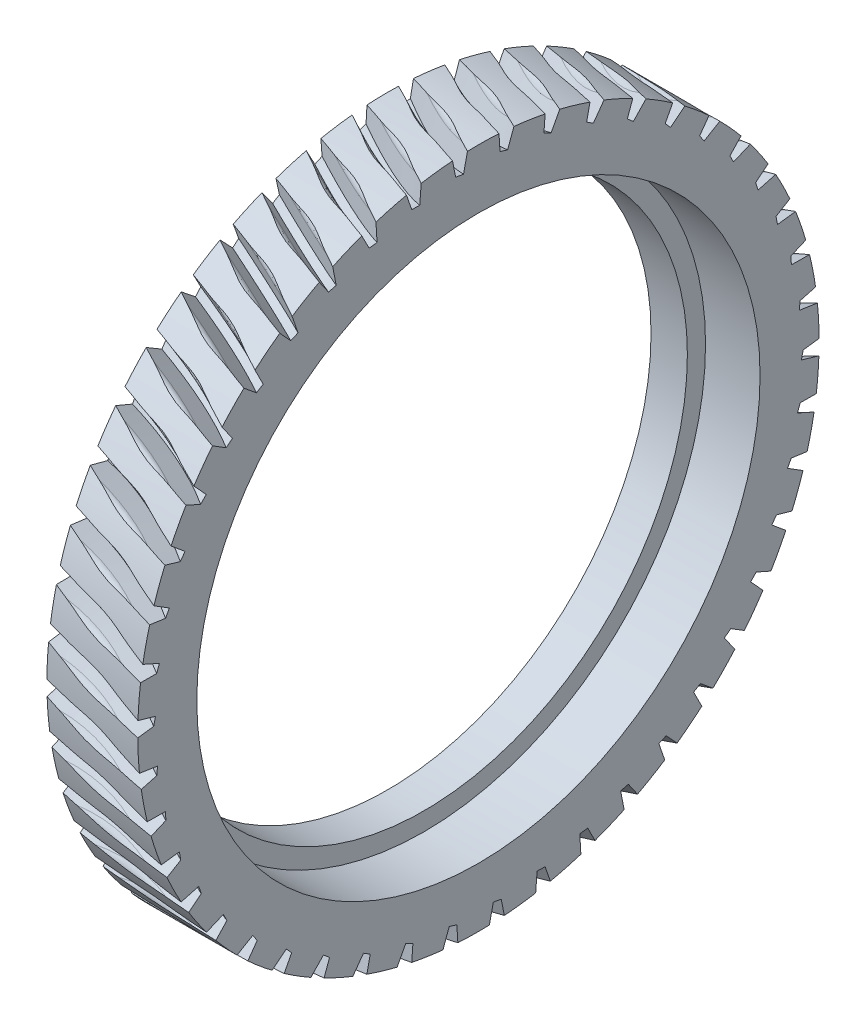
from build123d import *

# Parameters (mm, degrees)
R_P_TITION_CIRCULAIRE1_COUNT = 46


with BuildPart() as part:
    # Esquisse1 → Base-R_volution (revolve)
    with BuildSketch(Plane.XY, mode=Mode.PRIVATE) as base_r_volution_sk:
        Polygon((0, 31), (0, 37.5), (-10, 37.5), (-10, 29), (-6, 29), (-6, 31), align=None)
    revolve(base_r_volution_sk.sketch.rotate(Axis((0, 0, 0), (1, 0, 0)), 90), axis=Axis((0, 0, 0), (1, 0, 0)))

    # Esquisse4 → Enlever de la mati_re-R_volution1 (revolve, cut)
    with BuildSketch(Plane(origin=(-4.267766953, 0, -1.767766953), x_dir=(-0.3826834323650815, 0, 0.9238795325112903), z_dir=(-0.9238795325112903, 0, -0.3826834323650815))):
        with BuildLine():
            Line((1.001599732, 36.907911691), (1.513417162, 34.5))
            Line((1.513417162, 34.5), (2.313417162, 34.5))
            Line((2.313417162, 34.5), (2.825234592, 36.907911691))
            ThreePointArc((2.825234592, 36.907911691), (3.174061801, 37.477145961), (3.803382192, 37.7))
            Line((3.803382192, 37.7), (8.1, 37.7))
            Line((8.1, 37.7), (8.1, 39.7))
            Line((8.1, 39.7), (-3.9, 39.7))
            Line((-3.9, 39.7), (-3.9, 37.7))
            Line((-3.9, 37.7), (0.023452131, 37.7))
            ThreePointArc((0.023452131, 37.7), (0.652772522, 37.477145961), (1.001599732, 36.907911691))
        make_face()
    enlever_de_la_mati_re_r_volution1 = revolve(axis=Axis((1.051532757, 48.5, -14.609692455), (-0.38268343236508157, 0, 0.9238795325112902)), mode=Mode.SUBTRACT)

    # R_p_tition circulaire1: Enlever de la mati_re-R_volution1 ×46 about axis
    r_p_tition_circulaire1_axis = Axis((0, 0, 0), (1, 0, 0))
    for i in range(1, R_P_TITION_CIRCULAIRE1_COUNT):
        add(enlever_de_la_mati_re_r_volution1.rotate(r_p_tition_circulaire1_axis, i * 360 / R_P_TITION_CIRCULAIRE1_COUNT), mode=Mode.SUBTRACT)


solid = part.part
